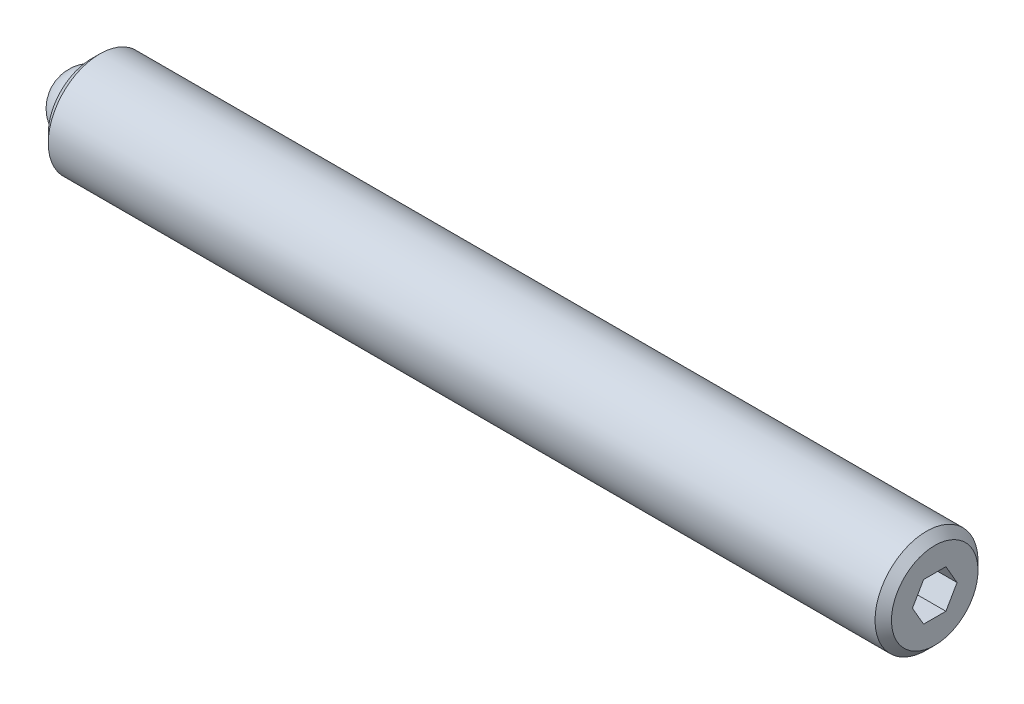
from build123d import *

# Parameters (mm, degrees)
SKETCH2_R           = 3.175
BOSS_EXTRUDE1_DEPTH = 51.990625
CHAMFER1_SIZE       = 0.508
CHAMFER2_SIZE       = 0.508
CUT_EXTRUDE2_DEPTH  = 2.286
SKETCH3_R           = 1.9812
CUT_EXTRUDE3_DEPTH  = 1.984375


with BuildPart() as part:
    # Sketch2 → Boss-Extrude1 (new body)
    with BuildSketch(Plane(origin=(0, 0, 0), x_dir=(0, 0, -1), z_dir=(1, 0, 0))):
        with Locations(Location((0, 0, 0), (0, 0, 180))):
            Circle(SKETCH2_R)
    extrude(amount=BOSS_EXTRUDE1_DEPTH)

    # Chamfer1
    chamfer1_edges = [part.edges().sort_by_distance(p)[0] for p in [
        (0, 0, -3.175),
    ]]
    chamfer(chamfer1_edges, length=CHAMFER1_SIZE)

    # Chamfer2
    chamfer2_edges = [part.edges().sort_by_distance(p)[0] for p in [
        (51.990625, 0, -3.175),
    ]]
    chamfer(chamfer2_edges, length=CHAMFER2_SIZE)

    # Sketch4 → Cut-Extrude2 (cut)
    with BuildSketch(Plane(origin=(51.990625, 0, 0), x_dir=(0, 0, -1), z_dir=(1, 0, 0))):
        Polygon((1.374815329, 0), (0.687407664, 1.190625), (-0.687407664, 1.190625), (-1.374815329, 0), (-0.687407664, -1.190625), (0.687407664, -1.190625), align=None)
    extrude(amount=-CUT_EXTRUDE2_DEPTH, mode=Mode.SUBTRACT)

    # Sketch3 → Cut-Extrude3 (cut)
    with BuildSketch(Plane.ZY):
        Circle(SKETCH3_R)
    extrude(amount=-CUT_EXTRUDE3_DEPTH, mode=Mode.SUBTRACT)


with BuildPart() as body_2:
    # Sketch5 → Revolve1 (revolve)
    with BuildSketch(Plane.ZY):
        with BuildLine():
            Line((0, 0), (0, -1.984375))
            ThreePointArc((0, -1.984375), (-1.984375, 0), (0, 1.984375))
            Line((0, 1.984375), (0, 0))
        make_face()
    revolve(axis=Axis((0, 0, 0), (0, 1, 0)))


solid = Compound([part.part, body_2.part])
